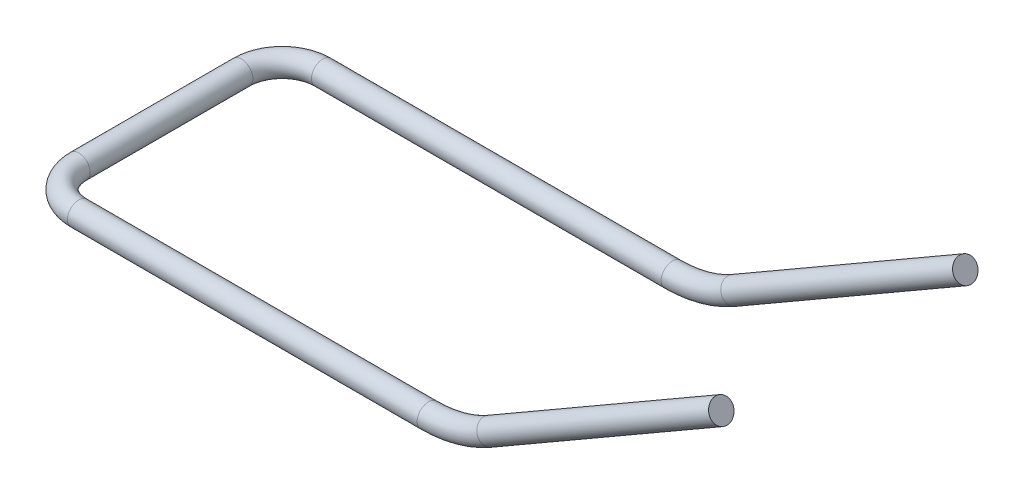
ISO-10303-21;
HEADER;
FILE_DESCRIPTION(('STEP AP214'),'2;1');
FILE_NAME('part.step','',(''),(''),'','','');
FILE_SCHEMA(('AUTOMOTIVE_DESIGN { 1 0 10303 214 1 1 1 1 }'));
ENDSEC;
DATA;
#1=APPLICATION_CONTEXT('core data for automotive mechanical design processes');
#2=APPLICATION_PROTOCOL_DEFINITION('international standard','automotive_design',2000,#1);
#3=PRODUCT_CONTEXT('',#1,'mechanical');
#4=PRODUCT('Part','Part','',(#3));
#5=PRODUCT_RELATED_PRODUCT_CATEGORY('part','',(#4));
#6=PRODUCT_DEFINITION_FORMATION('','',#4);
#7=PRODUCT_DEFINITION_CONTEXT('part definition',#1,'design');
#8=PRODUCT_DEFINITION('design','',#6,#7);
#9=PRODUCT_DEFINITION_SHAPE('','',#8);
#10=(LENGTH_UNIT() NAMED_UNIT(*) SI_UNIT(.MILLI.,.METRE.));
#11=(NAMED_UNIT(*) PLANE_ANGLE_UNIT() SI_UNIT($,.RADIAN.));
#12=(NAMED_UNIT(*) SI_UNIT($,.STERADIAN.) SOLID_ANGLE_UNIT());
#13=UNCERTAINTY_MEASURE_WITH_UNIT(LENGTH_MEASURE(1.E-05),#10,'distance_accuracy_value','');
#14=(GEOMETRIC_REPRESENTATION_CONTEXT(3) GLOBAL_UNCERTAINTY_ASSIGNED_CONTEXT((#13)) GLOBAL_UNIT_ASSIGNED_CONTEXT((#10,
#11,#12)) REPRESENTATION_CONTEXT('',''));
#15=CARTESIAN_POINT('',(0.,0.,0.));
#16=DIRECTION('',(0.,0.,1.));
#17=DIRECTION('',(1.,0.,0.));
#18=AXIS2_PLACEMENT_3D('',#15,#16,#17);
#19=CARTESIAN_POINT('',(277.5,10.0480947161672,-75.));
#20=DIRECTION('',(0.866025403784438,0.500000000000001,0.));
#21=DIRECTION('',(-0.500000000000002,0.866025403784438,0.));
#22=AXIS2_PLACEMENT_3D('',#19,#20,#21);
#23=CYLINDRICAL_SURFACE('',#22,7.);
#24=CARTESIAN_POINT('',(277.5,10.0480947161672,-75.));
#25=DIRECTION('',(-0.866025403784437,-0.500000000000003,0.));
#26=DIRECTION('',(-0.500000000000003,0.866025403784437,0.));
#27=AXIS2_PLACEMENT_3D('',#24,#25,#26);
#28=CIRCLE('',#27,7.);
#29=CARTESIAN_POINT('',(281.,3.98591688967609,-75.));
#30=VERTEX_POINT('',#29);
#31=EDGE_CURVE('E36',#30,#30,#28,.T.);
#32=ORIENTED_EDGE('',*,*,#31,.F.);
#33=EDGE_LOOP('',(#32));
#34=FACE_BOUND('',#33,.T.);
#35=CARTESIAN_POINT('',(420.,92.3205080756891,-75.));
#36=DIRECTION('',(-0.866025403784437,-0.500000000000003,0.));
#37=DIRECTION('',(-0.500000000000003,0.866025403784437,0.));
#38=AXIS2_PLACEMENT_3D('',#35,#36,#37);
#39=CIRCLE('',#38,7.);
#40=CARTESIAN_POINT('',(416.5,98.3826859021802,-75.));
#41=VERTEX_POINT('',#40);
#42=EDGE_CURVE('E10',#41,#41,#39,.T.);
#43=ORIENTED_EDGE('',*,*,#42,.T.);
#44=EDGE_LOOP('',(#43));
#45=FACE_BOUND('',#44,.T.);
#46=ADVANCED_FACE('F30',(#34,#45),#23,.T.);
#47=CARTESIAN_POINT('',(240.,75.,-75.));
#48=DIRECTION('',(0.,0.,1.));
#49=DIRECTION('',(1.,0.,0.));
#50=AXIS2_PLACEMENT_3D('',#47,#48,#49);
#51=TOROIDAL_SURFACE('',#50,75.,7.);
#52=CARTESIAN_POINT('',(240.,0.,-75.));
#53=DIRECTION('',(-1.,0.,0.));
#54=DIRECTION('',(0.,1.,0.));
#55=AXIS2_PLACEMENT_3D('',#52,#53,#54);
#56=CIRCLE('',#55,7.);
#57=CARTESIAN_POINT('',(240.,-7.00000000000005,-75.));
#58=VERTEX_POINT('',#57);
#59=EDGE_CURVE('E40',#58,#58,#56,.T.);
#60=CARTESIAN_POINT('',(240.,75.,-75.));
#61=DIRECTION('',(0.,0.,1.));
#62=DIRECTION('',(1.,0.,0.));
#63=AXIS2_PLACEMENT_3D('',#60,#61,#62);
#64=CIRCLE('',#63,82.);
#65=EDGE_CURVE('',#58,#30,#64,.T.);
#66=ORIENTED_EDGE('',*,*,#59,.F.);
#67=ORIENTED_EDGE('',*,*,#31,.T.);
#68=ORIENTED_EDGE('',*,*,#65,.T.);
#69=ORIENTED_EDGE('',*,*,#65,.F.);
#70=EDGE_LOOP('',(#66,#68,#67,#69));
#71=FACE_BOUND('',#70,.T.);
#72=ADVANCED_FACE('F104',(#71),#51,.T.);
#73=CARTESIAN_POINT('',(24.9999999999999,0.,-75.));
#74=DIRECTION('',(1.,0.,0.));
#75=DIRECTION('',(0.,0.,-1.));
#76=AXIS2_PLACEMENT_3D('',#73,#74,#75);
#77=CYLINDRICAL_SURFACE('',#76,7.);
#78=CARTESIAN_POINT('',(24.9999999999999,0.,-75.));
#79=DIRECTION('',(-1.,0.,0.));
#80=DIRECTION('',(0.,1.,0.));
#81=AXIS2_PLACEMENT_3D('',#78,#79,#80);
#82=CIRCLE('',#81,7.);
#83=CARTESIAN_POINT('',(24.9999999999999,0.,-82.));
#84=VERTEX_POINT('',#83);
#85=EDGE_CURVE('E44',#84,#84,#82,.T.);
#86=ORIENTED_EDGE('',*,*,#85,.F.);
#87=EDGE_LOOP('',(#86));
#88=FACE_BOUND('',#87,.T.);
#89=ORIENTED_EDGE('',*,*,#59,.T.);
#90=EDGE_LOOP('',(#89));
#91=FACE_BOUND('',#90,.T.);
#92=ADVANCED_FACE('F98',(#88,#91),#77,.T.);
#93=CARTESIAN_POINT('',(25.,0.,-50.));
#94=DIRECTION('',(0.,-1.,0.));
#95=DIRECTION('',(0.,0.,-1.));
#96=AXIS2_PLACEMENT_3D('',#93,#94,#95);
#97=TOROIDAL_SURFACE('',#96,25.,7.);
#98=CARTESIAN_POINT('',(0.,0.,-49.9999999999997));
#99=DIRECTION('',(0.,0.,1.));
#100=DIRECTION('',(0.,1.,0.));
#101=AXIS2_PLACEMENT_3D('',#98,#99,#100);
#102=CIRCLE('',#101,7.);
#103=CARTESIAN_POINT('',(-6.99999999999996,0.,-49.9999999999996));
#104=VERTEX_POINT('',#103);
#105=EDGE_CURVE('E49',#104,#104,#102,.T.);
#106=CARTESIAN_POINT('',(25.,0.,-50.));
#107=DIRECTION('',(0.,-1.,0.));
#108=DIRECTION('',(0.,0.,-1.));
#109=AXIS2_PLACEMENT_3D('',#106,#107,#108);
#110=CIRCLE('',#109,32.);
#111=EDGE_CURVE('',#104,#84,#110,.T.);
#112=ORIENTED_EDGE('',*,*,#105,.F.);
#113=ORIENTED_EDGE('',*,*,#85,.T.);
#114=ORIENTED_EDGE('',*,*,#111,.T.);
#115=ORIENTED_EDGE('',*,*,#111,.F.);
#116=EDGE_LOOP('',(#112,#114,#113,#115));
#117=FACE_BOUND('',#116,.T.);
#118=ADVANCED_FACE('F92',(#117),#97,.T.);
#119=CARTESIAN_POINT('',(0.,0.,50.0000000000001));
#120=DIRECTION('',(0.,0.,-1.));
#121=DIRECTION('',(-1.,0.,0.));
#122=AXIS2_PLACEMENT_3D('',#119,#120,#121);
#123=CYLINDRICAL_SURFACE('',#122,7.);
#124=CARTESIAN_POINT('',(0.,0.,50.0000000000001));
#125=DIRECTION('',(0.,0.,1.));
#126=DIRECTION('',(0.,1.,0.));
#127=AXIS2_PLACEMENT_3D('',#124,#125,#126);
#128=CIRCLE('',#127,7.);
#129=CARTESIAN_POINT('',(-6.99999999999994,0.,50.0000000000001));
#130=VERTEX_POINT('',#129);
#131=EDGE_CURVE('E52',#130,#130,#128,.T.);
#132=ORIENTED_EDGE('',*,*,#131,.F.);
#133=EDGE_LOOP('',(#132));
#134=FACE_BOUND('',#133,.T.);
#135=ORIENTED_EDGE('',*,*,#105,.T.);
#136=EDGE_LOOP('',(#135));
#137=FACE_BOUND('',#136,.T.);
#138=ADVANCED_FACE('F86',(#134,#137),#123,.T.);
#139=CARTESIAN_POINT('',(25.,0.,50.));
#140=DIRECTION('',(0.,-1.,0.));
#141=DIRECTION('',(0.,0.,-1.));
#142=AXIS2_PLACEMENT_3D('',#139,#140,#141);
#143=TOROIDAL_SURFACE('',#142,25.,7.);
#144=CARTESIAN_POINT('',(25.0000000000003,0.,75.));
#145=DIRECTION('',(1.,0.,0.));
#146=DIRECTION('',(0.,1.,0.));
#147=AXIS2_PLACEMENT_3D('',#144,#145,#146);
#148=CIRCLE('',#147,7.);
#149=CARTESIAN_POINT('',(25.0000000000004,0.,82.));
#150=VERTEX_POINT('',#149);
#151=EDGE_CURVE('E55',#150,#150,#148,.T.);
#152=CARTESIAN_POINT('',(25.,0.,50.));
#153=DIRECTION('',(0.,-1.,0.));
#154=DIRECTION('',(0.,0.,-1.));
#155=AXIS2_PLACEMENT_3D('',#152,#153,#154);
#156=CIRCLE('',#155,32.);
#157=EDGE_CURVE('',#150,#130,#156,.T.);
#158=ORIENTED_EDGE('',*,*,#151,.F.);
#159=ORIENTED_EDGE('',*,*,#131,.T.);
#160=ORIENTED_EDGE('',*,*,#157,.T.);
#161=ORIENTED_EDGE('',*,*,#157,.F.);
#162=EDGE_LOOP('',(#158,#160,#159,#161));
#163=FACE_BOUND('',#162,.T.);
#164=ADVANCED_FACE('F80',(#163),#143,.T.);
#165=CARTESIAN_POINT('',(240.,0.,75.));
#166=DIRECTION('',(-1.,0.,0.));
#167=DIRECTION('',(0.,0.,1.));
#168=AXIS2_PLACEMENT_3D('',#165,#166,#167);
#169=CYLINDRICAL_SURFACE('',#168,7.);
#170=CARTESIAN_POINT('',(240.,0.,75.));
#171=DIRECTION('',(1.,0.,0.));
#172=DIRECTION('',(0.,1.,0.));
#173=AXIS2_PLACEMENT_3D('',#170,#171,#172);
#174=CIRCLE('',#173,7.);
#175=CARTESIAN_POINT('',(240.,-7.00000000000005,75.));
#176=VERTEX_POINT('',#175);
#177=EDGE_CURVE('E58',#176,#176,#174,.T.);
#178=ORIENTED_EDGE('',*,*,#177,.F.);
#179=EDGE_LOOP('',(#178));
#180=FACE_BOUND('',#179,.T.);
#181=ORIENTED_EDGE('',*,*,#151,.T.);
#182=EDGE_LOOP('',(#181));
#183=FACE_BOUND('',#182,.T.);
#184=ADVANCED_FACE('F74',(#180,#183),#169,.T.);
#185=CARTESIAN_POINT('',(240.,75.,75.));
#186=DIRECTION('',(0.,0.,-1.));
#187=DIRECTION('',(-1.,0.,0.));
#188=AXIS2_PLACEMENT_3D('',#185,#186,#187);
#189=TOROIDAL_SURFACE('',#188,75.,7.);
#190=CARTESIAN_POINT('',(277.5,10.0480947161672,75.));
#191=DIRECTION('',(0.866025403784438,0.500000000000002,0.));
#192=DIRECTION('',(-0.500000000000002,0.866025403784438,0.));
#193=AXIS2_PLACEMENT_3D('',#190,#191,#192);
#194=CIRCLE('',#193,7.);
#195=CARTESIAN_POINT('',(281.,3.9859168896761,75.));
#196=VERTEX_POINT('',#195);
#197=EDGE_CURVE('E61',#196,#196,#194,.T.);
#198=CARTESIAN_POINT('',(240.,75.,75.));
#199=DIRECTION('',(0.,0.,-1.));
#200=DIRECTION('',(-1.,0.,0.));
#201=AXIS2_PLACEMENT_3D('',#198,#199,#200);
#202=CIRCLE('',#201,82.);
#203=EDGE_CURVE('',#196,#176,#202,.T.);
#204=ORIENTED_EDGE('',*,*,#197,.F.);
#205=ORIENTED_EDGE('',*,*,#177,.T.);
#206=ORIENTED_EDGE('',*,*,#203,.T.);
#207=ORIENTED_EDGE('',*,*,#203,.F.);
#208=EDGE_LOOP('',(#204,#206,#205,#207));
#209=FACE_BOUND('',#208,.T.);
#210=ADVANCED_FACE('F71',(#209),#189,.T.);
#211=CARTESIAN_POINT('',(277.5,10.0480947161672,75.));
#212=DIRECTION('',(0.866025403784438,0.500000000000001,0.));
#213=DIRECTION('',(-0.500000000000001,0.866025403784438,0.));
#214=AXIS2_PLACEMENT_3D('',#211,#212,#213);
#215=CYLINDRICAL_SURFACE('',#214,7.);
#216=ORIENTED_EDGE('',*,*,#197,.T.);
#217=EDGE_LOOP('',(#216));
#218=FACE_BOUND('',#217,.T.);
#219=CARTESIAN_POINT('',(420.,92.3205080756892,75.));
#220=DIRECTION('',(0.866025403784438,0.500000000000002,0.));
#221=DIRECTION('',(-0.500000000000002,0.866025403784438,0.));
#222=AXIS2_PLACEMENT_3D('',#219,#220,#221);
#223=CIRCLE('',#222,7.);
#224=CARTESIAN_POINT('',(416.5,98.3826859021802,75.));
#225=VERTEX_POINT('',#224);
#226=EDGE_CURVE('E62',#225,#225,#223,.T.);
#227=ORIENTED_EDGE('',*,*,#226,.F.);
#228=EDGE_LOOP('',(#227));
#229=FACE_BOUND('',#228,.T.);
#230=ADVANCED_FACE('F68',(#218,#229),#215,.T.);
#231=CARTESIAN_POINT('',(420.,92.3205080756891,-75.));
#232=DIRECTION('',(-0.866025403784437,-0.500000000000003,0.));
#233=DIRECTION('',(-0.500000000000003,0.866025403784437,0.));
#234=AXIS2_PLACEMENT_3D('',#231,#232,#233);
#235=PLANE('',#234);
#236=ORIENTED_EDGE('',*,*,#42,.F.);
#237=EDGE_LOOP('',(#236));
#238=FACE_BOUND('',#237,.T.);
#239=ADVANCED_FACE('F116',(#238),#235,.F.);
#240=CARTESIAN_POINT('',(420.,92.3205080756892,75.));
#241=DIRECTION('',(0.866025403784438,0.500000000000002,0.));
#242=DIRECTION('',(-0.500000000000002,0.866025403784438,0.));
#243=AXIS2_PLACEMENT_3D('',#240,#241,#242);
#244=PLANE('',#243);
#245=ORIENTED_EDGE('',*,*,#226,.T.);
#246=EDGE_LOOP('',(#245));
#247=FACE_BOUND('',#246,.T.);
#248=ADVANCED_FACE('F117',(#247),#244,.T.);
#249=CLOSED_SHELL('',(#46,#72,#92,#118,#138,#164,#184,#210,#230,#239,#248));
#250=MANIFOLD_SOLID_BREP('B2',#249);
#251=ADVANCED_BREP_SHAPE_REPRESENTATION('',(#18,#250),#14);
#252=SHAPE_DEFINITION_REPRESENTATION(#9,#251);
ENDSEC;
END-ISO-10303-21;
